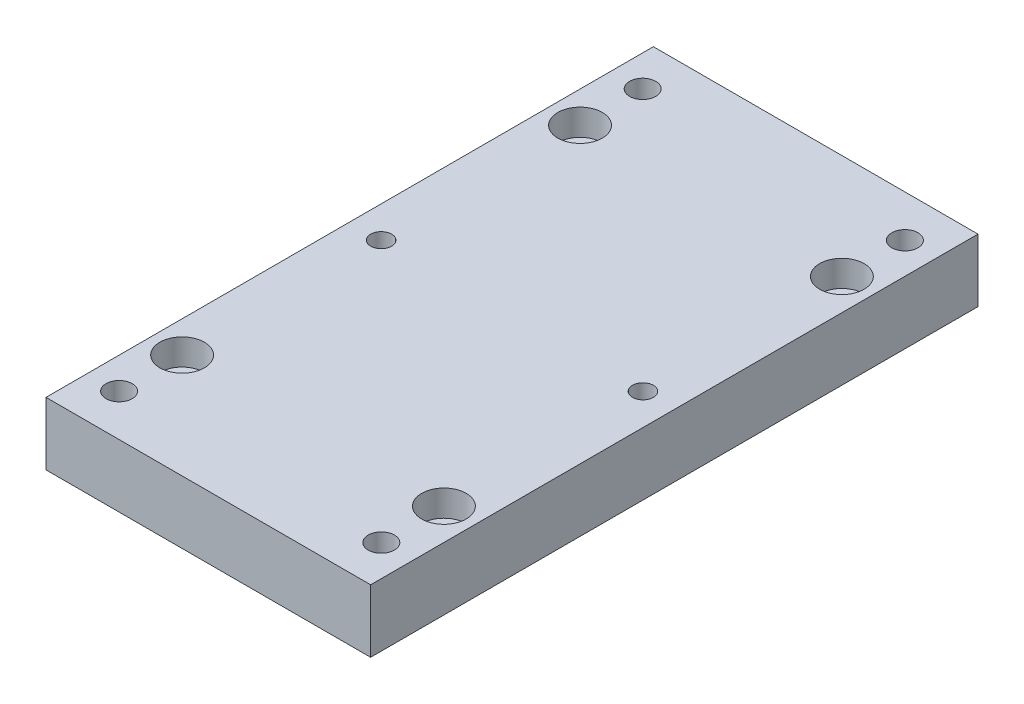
ISO-10303-21;
HEADER;
FILE_DESCRIPTION(('STEP AP214'),'2;1');
FILE_NAME('part.step','',(''),(''),'','','');
FILE_SCHEMA(('AUTOMOTIVE_DESIGN { 1 0 10303 214 1 1 1 1 }'));
ENDSEC;
DATA;
#1=APPLICATION_CONTEXT('core data for automotive mechanical design processes');
#2=APPLICATION_PROTOCOL_DEFINITION('international standard','automotive_design',2000,#1);
#3=PRODUCT_CONTEXT('',#1,'mechanical');
#4=PRODUCT('Part','Part','',(#3));
#5=PRODUCT_RELATED_PRODUCT_CATEGORY('part','',(#4));
#6=PRODUCT_DEFINITION_FORMATION('','',#4);
#7=PRODUCT_DEFINITION_CONTEXT('part definition',#1,'design');
#8=PRODUCT_DEFINITION('design','',#6,#7);
#9=PRODUCT_DEFINITION_SHAPE('','',#8);
#10=(LENGTH_UNIT() NAMED_UNIT(*) SI_UNIT(.MILLI.,.METRE.));
#11=(NAMED_UNIT(*) PLANE_ANGLE_UNIT() SI_UNIT($,.RADIAN.));
#12=(NAMED_UNIT(*) SI_UNIT($,.STERADIAN.) SOLID_ANGLE_UNIT());
#13=UNCERTAINTY_MEASURE_WITH_UNIT(LENGTH_MEASURE(1.E-05),#10,'distance_accuracy_value','');
#14=(GEOMETRIC_REPRESENTATION_CONTEXT(3) GLOBAL_UNCERTAINTY_ASSIGNED_CONTEXT((#13)) GLOBAL_UNIT_ASSIGNED_CONTEXT((#10,
#11,#12)) REPRESENTATION_CONTEXT('',''));
#15=CARTESIAN_POINT('',(0.,0.,0.));
#16=DIRECTION('',(0.,0.,1.));
#17=DIRECTION('',(1.,0.,0.));
#18=AXIS2_PLACEMENT_3D('',#15,#16,#17);
#19=CARTESIAN_POINT('',(49.2125,19.05,-92.075));
#20=DIRECTION('',(-1.,0.,0.));
#21=DIRECTION('',(0.,0.,1.));
#22=AXIS2_PLACEMENT_3D('',#19,#20,#21);
#23=PLANE('',#22);
#24=DIRECTION('',(0.,0.,-1.));
#25=VECTOR('',#24,1.);
#26=CARTESIAN_POINT('',(49.2125,0.,-92.075));
#27=LINE('',#26,#25);
#28=CARTESIAN_POINT('',(49.2125,0.,92.075));
#29=VERTEX_POINT('',#28);
#30=CARTESIAN_POINT('',(49.2125,0.,-92.075));
#31=VERTEX_POINT('',#30);
#32=EDGE_CURVE('E99',#29,#31,#27,.T.);
#33=ORIENTED_EDGE('',*,*,#32,.T.);
#34=DIRECTION('',(0.,-1.,0.));
#35=VECTOR('',#34,1.);
#36=CARTESIAN_POINT('',(49.2125,19.05,-92.075));
#37=LINE('',#36,#35);
#38=CARTESIAN_POINT('',(49.2125,19.05,-92.075));
#39=VERTEX_POINT('',#38);
#40=EDGE_CURVE('E11',#39,#31,#37,.T.);
#41=ORIENTED_EDGE('',*,*,#40,.F.);
#42=DIRECTION('',(0.,0.,-1.));
#43=VECTOR('',#42,1.);
#44=CARTESIAN_POINT('',(49.2125,19.05,-92.075));
#45=LINE('',#44,#43);
#46=CARTESIAN_POINT('',(49.2125,19.05,92.075));
#47=VERTEX_POINT('',#46);
#48=EDGE_CURVE('E87',#47,#39,#45,.T.);
#49=ORIENTED_EDGE('',*,*,#48,.F.);
#50=DIRECTION('',(0.,-1.,0.));
#51=VECTOR('',#50,1.);
#52=CARTESIAN_POINT('',(49.2125,19.05,92.075));
#53=LINE('',#52,#51);
#54=EDGE_CURVE('E95',#47,#29,#53,.T.);
#55=ORIENTED_EDGE('',*,*,#54,.T.);
#56=EDGE_LOOP('',(#33,#41,#49,#55));
#57=FACE_BOUND('',#56,.T.);
#58=ADVANCED_FACE('F36',(#57),#23,.F.);
#59=CARTESIAN_POINT('',(-49.2125,19.05,-92.075));
#60=DIRECTION('',(0.,0.,1.));
#61=DIRECTION('',(1.,0.,0.));
#62=AXIS2_PLACEMENT_3D('',#59,#60,#61);
#63=PLANE('',#62);
#64=DIRECTION('',(-1.,0.,0.));
#65=VECTOR('',#64,1.);
#66=CARTESIAN_POINT('',(-49.2125,0.,-92.075));
#67=LINE('',#66,#65);
#68=CARTESIAN_POINT('',(-49.2125,0.,-92.075));
#69=VERTEX_POINT('',#68);
#70=EDGE_CURVE('E91',#31,#69,#67,.T.);
#71=ORIENTED_EDGE('',*,*,#70,.T.);
#72=DIRECTION('',(0.,-1.,0.));
#73=VECTOR('',#72,1.);
#74=CARTESIAN_POINT('',(-49.2125,19.05,-92.075));
#75=LINE('',#74,#73);
#76=CARTESIAN_POINT('',(-49.2125,19.05,-92.075));
#77=VERTEX_POINT('',#76);
#78=EDGE_CURVE('E44',#77,#69,#75,.T.);
#79=ORIENTED_EDGE('',*,*,#78,.F.);
#80=DIRECTION('',(-1.,0.,0.));
#81=VECTOR('',#80,1.);
#82=CARTESIAN_POINT('',(-49.2125,19.05,-92.075));
#83=LINE('',#82,#81);
#84=EDGE_CURVE('E82',#39,#77,#83,.T.);
#85=ORIENTED_EDGE('',*,*,#84,.F.);
#86=ORIENTED_EDGE('',*,*,#40,.T.);
#87=EDGE_LOOP('',(#71,#79,#85,#86));
#88=FACE_BOUND('',#87,.T.);
#89=ADVANCED_FACE('F90',(#88),#63,.F.);
#90=CARTESIAN_POINT('',(-49.2125,19.05,-92.075));
#91=DIRECTION('',(1.,0.,0.));
#92=DIRECTION('',(0.,0.,-1.));
#93=AXIS2_PLACEMENT_3D('',#90,#91,#92);
#94=PLANE('',#93);
#95=DIRECTION('',(0.,0.,1.));
#96=VECTOR('',#95,1.);
#97=CARTESIAN_POINT('',(-49.2125,0.,-92.075));
#98=LINE('',#97,#96);
#99=CARTESIAN_POINT('',(-49.2125,0.,92.075));
#100=VERTEX_POINT('',#99);
#101=EDGE_CURVE('E69',#69,#100,#98,.T.);
#102=ORIENTED_EDGE('',*,*,#101,.T.);
#103=DIRECTION('',(0.,-1.,0.));
#104=VECTOR('',#103,1.);
#105=CARTESIAN_POINT('',(-49.2125,19.05,92.075));
#106=LINE('',#105,#104);
#107=CARTESIAN_POINT('',(-49.2125,19.05,92.075));
#108=VERTEX_POINT('',#107);
#109=EDGE_CURVE('E92',#108,#100,#106,.T.);
#110=ORIENTED_EDGE('',*,*,#109,.F.);
#111=DIRECTION('',(0.,0.,1.));
#112=VECTOR('',#111,1.);
#113=CARTESIAN_POINT('',(-49.2125,19.05,-92.075));
#114=LINE('',#113,#112);
#115=EDGE_CURVE('E85',#77,#108,#114,.T.);
#116=ORIENTED_EDGE('',*,*,#115,.F.);
#117=ORIENTED_EDGE('',*,*,#78,.T.);
#118=EDGE_LOOP('',(#102,#110,#116,#117));
#119=FACE_BOUND('',#118,.T.);
#120=ADVANCED_FACE('F93',(#119),#94,.F.);
#121=CARTESIAN_POINT('',(-49.2125,19.05,92.075));
#122=DIRECTION('',(0.,0.,-1.));
#123=DIRECTION('',(-1.,0.,0.));
#124=AXIS2_PLACEMENT_3D('',#121,#122,#123);
#125=PLANE('',#124);
#126=DIRECTION('',(1.,0.,0.));
#127=VECTOR('',#126,1.);
#128=CARTESIAN_POINT('',(-49.2125,0.,92.075));
#129=LINE('',#128,#127);
#130=EDGE_CURVE('E75',#100,#29,#129,.T.);
#131=ORIENTED_EDGE('',*,*,#130,.T.);
#132=ORIENTED_EDGE('',*,*,#54,.F.);
#133=DIRECTION('',(1.,0.,0.));
#134=VECTOR('',#133,1.);
#135=CARTESIAN_POINT('',(-49.2125,19.05,92.075));
#136=LINE('',#135,#134);
#137=EDGE_CURVE('E52',#108,#47,#136,.T.);
#138=ORIENTED_EDGE('',*,*,#137,.F.);
#139=ORIENTED_EDGE('',*,*,#109,.T.);
#140=EDGE_LOOP('',(#131,#132,#138,#139));
#141=FACE_BOUND('',#140,.T.);
#142=ADVANCED_FACE('F107',(#141),#125,.F.);
#143=CARTESIAN_POINT('',(0.,19.05,0.));
#144=DIRECTION('',(0.,1.,0.));
#145=DIRECTION('',(0.,0.,1.));
#146=AXIS2_PLACEMENT_3D('',#143,#144,#145);
#147=PLANE('',#146);
#148=CARTESIAN_POINT('',(-39.751,19.05,-79.3749999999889));
#149=DIRECTION('',(0.,1.,0.));
#150=DIRECTION('',(0.,0.,1.));
#151=AXIS2_PLACEMENT_3D('',#148,#149,#150);
#152=CIRCLE('',#151,3.96875);
#153=CARTESIAN_POINT('',(-39.751,19.05,-75.4062499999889));
#154=VERTEX_POINT('',#153);
#155=EDGE_CURVE('E193',#154,#154,#152,.T.);
#156=ORIENTED_EDGE('',*,*,#155,.F.);
#157=EDGE_LOOP('',(#156));
#158=FACE_BOUND('',#157,.T.);
#159=CARTESIAN_POINT('',(39.751,19.05,-79.3749999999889));
#160=DIRECTION('',(0.,1.,0.));
#161=DIRECTION('',(0.,0.,1.));
#162=AXIS2_PLACEMENT_3D('',#159,#160,#161);
#163=CIRCLE('',#162,3.96875);
#164=CARTESIAN_POINT('',(39.751,19.05,-75.4062499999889));
#165=VERTEX_POINT('',#164);
#166=EDGE_CURVE('E187',#165,#165,#163,.T.);
#167=ORIENTED_EDGE('',*,*,#166,.F.);
#168=EDGE_LOOP('',(#167));
#169=FACE_BOUND('',#168,.T.);
#170=CARTESIAN_POINT('',(-39.751,19.05,79.3750000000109));
#171=DIRECTION('',(0.,1.,0.));
#172=DIRECTION('',(0.,0.,1.));
#173=AXIS2_PLACEMENT_3D('',#170,#171,#172);
#174=CIRCLE('',#173,3.96875);
#175=CARTESIAN_POINT('',(-39.751,19.05,83.3437500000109));
#176=VERTEX_POINT('',#175);
#177=EDGE_CURVE('E181',#176,#176,#174,.T.);
#178=ORIENTED_EDGE('',*,*,#177,.F.);
#179=EDGE_LOOP('',(#178));
#180=FACE_BOUND('',#179,.T.);
#181=CARTESIAN_POINT('',(39.751,19.05,79.3750000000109));
#182=DIRECTION('',(0.,1.,0.));
#183=DIRECTION('',(0.,0.,1.));
#184=AXIS2_PLACEMENT_3D('',#181,#182,#183);
#185=CIRCLE('',#184,3.96875);
#186=CARTESIAN_POINT('',(39.751,19.05,83.3437500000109));
#187=VERTEX_POINT('',#186);
#188=EDGE_CURVE('E175',#187,#187,#185,.T.);
#189=ORIENTED_EDGE('',*,*,#188,.F.);
#190=EDGE_LOOP('',(#189));
#191=FACE_BOUND('',#190,.T.);
#192=CARTESIAN_POINT('',(39.7002,19.05,0.));
#193=DIRECTION('',(0.,-1.,0.));
#194=DIRECTION('',(0.,0.,-1.));
#195=AXIS2_PLACEMENT_3D('',#192,#193,#194);
#196=CIRCLE('',#195,3.175);
#197=CARTESIAN_POINT('',(39.7002,19.05,-3.175));
#198=VERTEX_POINT('',#197);
#199=EDGE_CURVE('E166',#198,#198,#196,.T.);
#200=ORIENTED_EDGE('',*,*,#199,.T.);
#201=EDGE_LOOP('',(#200));
#202=FACE_BOUND('',#201,.T.);
#203=CARTESIAN_POINT('',(-39.6748,19.05,0.));
#204=DIRECTION('',(0.,-1.,0.));
#205=DIRECTION('',(0.,0.,-1.));
#206=AXIS2_PLACEMENT_3D('',#203,#204,#205);
#207=CIRCLE('',#206,3.175);
#208=CARTESIAN_POINT('',(-39.6748,19.05,-3.175));
#209=VERTEX_POINT('',#208);
#210=EDGE_CURVE('E160',#209,#209,#207,.T.);
#211=ORIENTED_EDGE('',*,*,#210,.T.);
#212=EDGE_LOOP('',(#211));
#213=FACE_BOUND('',#212,.T.);
#214=CARTESIAN_POINT('',(-39.6875,19.05,-60.325));
#215=DIRECTION('',(0.,1.,0.));
#216=DIRECTION('',(0.,0.,1.));
#217=AXIS2_PLACEMENT_3D('',#214,#215,#216);
#218=CIRCLE('',#217,6.74751);
#219=CARTESIAN_POINT('',(-39.6875,19.05,-53.57749));
#220=VERTEX_POINT('',#219);
#221=EDGE_CURVE('E157',#220,#220,#218,.T.);
#222=ORIENTED_EDGE('',*,*,#221,.F.);
#223=EDGE_LOOP('',(#222));
#224=FACE_BOUND('',#223,.T.);
#225=CARTESIAN_POINT('',(-39.6875,19.05,60.325));
#226=DIRECTION('',(0.,1.,0.));
#227=DIRECTION('',(0.,0.,1.));
#228=AXIS2_PLACEMENT_3D('',#225,#226,#227);
#229=CIRCLE('',#228,6.74751);
#230=CARTESIAN_POINT('',(-39.6875,19.05,67.07251));
#231=VERTEX_POINT('',#230);
#232=EDGE_CURVE('E145',#231,#231,#229,.T.);
#233=ORIENTED_EDGE('',*,*,#232,.F.);
#234=EDGE_LOOP('',(#233));
#235=FACE_BOUND('',#234,.T.);
#236=CARTESIAN_POINT('',(39.6875,19.05,-60.325));
#237=DIRECTION('',(0.,1.,0.));
#238=DIRECTION('',(0.,0.,1.));
#239=AXIS2_PLACEMENT_3D('',#236,#237,#238);
#240=CIRCLE('',#239,6.74751);
#241=CARTESIAN_POINT('',(39.6875,19.05,-53.57749));
#242=VERTEX_POINT('',#241);
#243=EDGE_CURVE('E133',#242,#242,#240,.T.);
#244=ORIENTED_EDGE('',*,*,#243,.F.);
#245=EDGE_LOOP('',(#244));
#246=FACE_BOUND('',#245,.T.);
#247=CARTESIAN_POINT('',(39.6875,19.05,60.325));
#248=DIRECTION('',(0.,1.,0.));
#249=DIRECTION('',(0.,0.,1.));
#250=AXIS2_PLACEMENT_3D('',#247,#248,#249);
#251=CIRCLE('',#250,6.74751);
#252=CARTESIAN_POINT('',(39.6875,19.05,67.07251));
#253=VERTEX_POINT('',#252);
#254=EDGE_CURVE('E121',#253,#253,#251,.T.);
#255=ORIENTED_EDGE('',*,*,#254,.F.);
#256=EDGE_LOOP('',(#255));
#257=FACE_BOUND('',#256,.T.);
#258=ORIENTED_EDGE('',*,*,#48,.T.);
#259=ORIENTED_EDGE('',*,*,#84,.T.);
#260=ORIENTED_EDGE('',*,*,#115,.T.);
#261=ORIENTED_EDGE('',*,*,#137,.T.);
#262=EDGE_LOOP('',(#258,#259,#260,#261));
#263=FACE_BOUND('',#262,.T.);
#264=ADVANCED_FACE('F83',(#158,#169,#180,#191,#202,#213,#224,#235,#246,#257,#263),#147,.T.);
#265=CARTESIAN_POINT('',(0.,0.,0.));
#266=DIRECTION('',(0.,1.,0.));
#267=DIRECTION('',(0.,0.,1.));
#268=AXIS2_PLACEMENT_3D('',#265,#266,#267);
#269=PLANE('',#268);
#270=CARTESIAN_POINT('',(-39.751,0.,-79.3749999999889));
#271=DIRECTION('',(0.,1.,0.));
#272=DIRECTION('',(0.,0.,1.));
#273=AXIS2_PLACEMENT_3D('',#270,#271,#272);
#274=CIRCLE('',#273,3.96874999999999);
#275=CARTESIAN_POINT('',(-39.751,0.,-75.4062499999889));
#276=VERTEX_POINT('',#275);
#277=EDGE_CURVE('E190',#276,#276,#274,.T.);
#278=ORIENTED_EDGE('',*,*,#277,.T.);
#279=EDGE_LOOP('',(#278));
#280=FACE_BOUND('',#279,.T.);
#281=CARTESIAN_POINT('',(39.751,0.,-79.3749999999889));
#282=DIRECTION('',(0.,1.,0.));
#283=DIRECTION('',(0.,0.,1.));
#284=AXIS2_PLACEMENT_3D('',#281,#282,#283);
#285=CIRCLE('',#284,3.96874999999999);
#286=CARTESIAN_POINT('',(39.751,0.,-75.4062499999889));
#287=VERTEX_POINT('',#286);
#288=EDGE_CURVE('E184',#287,#287,#285,.T.);
#289=ORIENTED_EDGE('',*,*,#288,.T.);
#290=EDGE_LOOP('',(#289));
#291=FACE_BOUND('',#290,.T.);
#292=CARTESIAN_POINT('',(-39.751,0.,79.3750000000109));
#293=DIRECTION('',(0.,1.,0.));
#294=DIRECTION('',(0.,0.,1.));
#295=AXIS2_PLACEMENT_3D('',#292,#293,#294);
#296=CIRCLE('',#295,3.96875);
#297=CARTESIAN_POINT('',(-39.751,0.,83.3437500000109));
#298=VERTEX_POINT('',#297);
#299=EDGE_CURVE('E178',#298,#298,#296,.T.);
#300=ORIENTED_EDGE('',*,*,#299,.T.);
#301=EDGE_LOOP('',(#300));
#302=FACE_BOUND('',#301,.T.);
#303=CARTESIAN_POINT('',(39.751,0.,79.3750000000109));
#304=DIRECTION('',(0.,1.,0.));
#305=DIRECTION('',(0.,0.,1.));
#306=AXIS2_PLACEMENT_3D('',#303,#304,#305);
#307=CIRCLE('',#306,3.96875);
#308=CARTESIAN_POINT('',(39.751,0.,83.3437500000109));
#309=VERTEX_POINT('',#308);
#310=EDGE_CURVE('E172',#309,#309,#307,.T.);
#311=ORIENTED_EDGE('',*,*,#310,.T.);
#312=EDGE_LOOP('',(#311));
#313=FACE_BOUND('',#312,.T.);
#314=CARTESIAN_POINT('',(39.7002,0.,0.));
#315=DIRECTION('',(0.,-1.,0.));
#316=DIRECTION('',(0.,0.,-1.));
#317=AXIS2_PLACEMENT_3D('',#314,#315,#316);
#318=CIRCLE('',#317,3.175);
#319=CARTESIAN_POINT('',(39.7002,0.,-3.175));
#320=VERTEX_POINT('',#319);
#321=EDGE_CURVE('E169',#320,#320,#318,.T.);
#322=ORIENTED_EDGE('',*,*,#321,.F.);
#323=EDGE_LOOP('',(#322));
#324=FACE_BOUND('',#323,.T.);
#325=CARTESIAN_POINT('',(-39.6748,0.,0.));
#326=DIRECTION('',(0.,-1.,0.));
#327=DIRECTION('',(0.,0.,-1.));
#328=AXIS2_PLACEMENT_3D('',#325,#326,#327);
#329=CIRCLE('',#328,3.175);
#330=CARTESIAN_POINT('',(-39.6748,0.,-3.175));
#331=VERTEX_POINT('',#330);
#332=EDGE_CURVE('E163',#331,#331,#329,.T.);
#333=ORIENTED_EDGE('',*,*,#332,.F.);
#334=EDGE_LOOP('',(#333));
#335=FACE_BOUND('',#334,.T.);
#336=CARTESIAN_POINT('',(-39.6875,0.,-60.325));
#337=DIRECTION('',(0.,1.,0.));
#338=DIRECTION('',(0.,0.,1.));
#339=AXIS2_PLACEMENT_3D('',#336,#337,#338);
#340=CIRCLE('',#339,4.21639999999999);
#341=CARTESIAN_POINT('',(-39.6875,0.,-56.1086));
#342=VERTEX_POINT('',#341);
#343=EDGE_CURVE('E148',#342,#342,#340,.T.);
#344=ORIENTED_EDGE('',*,*,#343,.T.);
#345=EDGE_LOOP('',(#344));
#346=FACE_BOUND('',#345,.T.);
#347=CARTESIAN_POINT('',(-39.6875,0.,60.325));
#348=DIRECTION('',(0.,1.,0.));
#349=DIRECTION('',(0.,0.,1.));
#350=AXIS2_PLACEMENT_3D('',#347,#348,#349);
#351=CIRCLE('',#350,4.21639999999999);
#352=CARTESIAN_POINT('',(-39.6875,0.,64.5414));
#353=VERTEX_POINT('',#352);
#354=EDGE_CURVE('E136',#353,#353,#351,.T.);
#355=ORIENTED_EDGE('',*,*,#354,.T.);
#356=EDGE_LOOP('',(#355));
#357=FACE_BOUND('',#356,.T.);
#358=CARTESIAN_POINT('',(39.6875,0.,-60.325));
#359=DIRECTION('',(0.,1.,0.));
#360=DIRECTION('',(0.,0.,1.));
#361=AXIS2_PLACEMENT_3D('',#358,#359,#360);
#362=CIRCLE('',#361,4.21639999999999);
#363=CARTESIAN_POINT('',(39.6875,0.,-56.1086));
#364=VERTEX_POINT('',#363);
#365=EDGE_CURVE('E124',#364,#364,#362,.T.);
#366=ORIENTED_EDGE('',*,*,#365,.T.);
#367=EDGE_LOOP('',(#366));
#368=FACE_BOUND('',#367,.T.);
#369=CARTESIAN_POINT('',(39.6875,0.,60.325));
#370=DIRECTION('',(0.,1.,0.));
#371=DIRECTION('',(0.,0.,1.));
#372=AXIS2_PLACEMENT_3D('',#369,#370,#371);
#373=CIRCLE('',#372,4.21639999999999);
#374=CARTESIAN_POINT('',(39.6875,0.,64.5414));
#375=VERTEX_POINT('',#374);
#376=EDGE_CURVE('E102',#375,#375,#373,.T.);
#377=ORIENTED_EDGE('',*,*,#376,.T.);
#378=EDGE_LOOP('',(#377));
#379=FACE_BOUND('',#378,.T.);
#380=ORIENTED_EDGE('',*,*,#32,.F.);
#381=ORIENTED_EDGE('',*,*,#130,.F.);
#382=ORIENTED_EDGE('',*,*,#101,.F.);
#383=ORIENTED_EDGE('',*,*,#70,.F.);
#384=EDGE_LOOP('',(#380,#381,#382,#383));
#385=FACE_BOUND('',#384,.T.);
#386=ADVANCED_FACE('F110',(#280,#291,#302,#313,#324,#335,#346,#357,#368,#379,#385),#269,.F.);
#387=CARTESIAN_POINT('',(39.6875,19.05,60.325));
#388=DIRECTION('',(0.,1.,0.));
#389=DIRECTION('',(0.,0.,1.));
#390=AXIS2_PLACEMENT_3D('',#387,#388,#389);
#391=CYLINDRICAL_SURFACE('',#390,4.21639999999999);
#392=ORIENTED_EDGE('',*,*,#376,.F.);
#393=EDGE_LOOP('',(#392));
#394=FACE_BOUND('',#393,.T.);
#395=CARTESIAN_POINT('',(39.6875,11.1125,60.325));
#396=DIRECTION('',(0.,1.,0.));
#397=DIRECTION('',(0.,0.,1.));
#398=AXIS2_PLACEMENT_3D('',#395,#396,#397);
#399=CIRCLE('',#398,4.21639999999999);
#400=CARTESIAN_POINT('',(39.6875,11.1125,64.5414));
#401=VERTEX_POINT('',#400);
#402=EDGE_CURVE('E115',#401,#401,#399,.T.);
#403=ORIENTED_EDGE('',*,*,#402,.T.);
#404=EDGE_LOOP('',(#403));
#405=FACE_BOUND('',#404,.T.);
#406=ADVANCED_FACE('F233',(#394,#405),#391,.F.);
#407=CARTESIAN_POINT('',(43.9039,11.1125,60.325));
#408=DIRECTION('',(0.,-1.,0.));
#409=DIRECTION('',(0.,0.,-1.));
#410=AXIS2_PLACEMENT_3D('',#407,#408,#409);
#411=PLANE('',#410);
#412=ORIENTED_EDGE('',*,*,#402,.F.);
#413=EDGE_LOOP('',(#412));
#414=FACE_BOUND('',#413,.T.);
#415=CARTESIAN_POINT('',(39.6875,11.1125,60.325));
#416=DIRECTION('',(0.,1.,0.));
#417=DIRECTION('',(0.,0.,1.));
#418=AXIS2_PLACEMENT_3D('',#415,#416,#417);
#419=CIRCLE('',#418,6.74751);
#420=CARTESIAN_POINT('',(39.6875,11.1125,67.07251));
#421=VERTEX_POINT('',#420);
#422=EDGE_CURVE('E118',#421,#421,#419,.T.);
#423=ORIENTED_EDGE('',*,*,#422,.T.);
#424=EDGE_LOOP('',(#423));
#425=FACE_BOUND('',#424,.T.);
#426=ADVANCED_FACE('F223',(#414,#425),#411,.F.);
#427=CARTESIAN_POINT('',(39.6875,19.05,60.325));
#428=DIRECTION('',(0.,1.,0.));
#429=DIRECTION('',(0.,0.,1.));
#430=AXIS2_PLACEMENT_3D('',#427,#428,#429);
#431=CYLINDRICAL_SURFACE('',#430,6.74751);
#432=ORIENTED_EDGE('',*,*,#422,.F.);
#433=EDGE_LOOP('',(#432));
#434=FACE_BOUND('',#433,.T.);
#435=ORIENTED_EDGE('',*,*,#254,.T.);
#436=EDGE_LOOP('',(#435));
#437=FACE_BOUND('',#436,.T.);
#438=ADVANCED_FACE('F220',(#434,#437),#431,.F.);
#439=CARTESIAN_POINT('',(39.6875,19.05,-60.325));
#440=DIRECTION('',(0.,1.,0.));
#441=DIRECTION('',(0.,0.,1.));
#442=AXIS2_PLACEMENT_3D('',#439,#440,#441);
#443=CYLINDRICAL_SURFACE('',#442,4.21639999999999);
#444=ORIENTED_EDGE('',*,*,#365,.F.);
#445=EDGE_LOOP('',(#444));
#446=FACE_BOUND('',#445,.T.);
#447=CARTESIAN_POINT('',(39.6875,11.1125,-60.325));
#448=DIRECTION('',(0.,1.,0.));
#449=DIRECTION('',(0.,0.,1.));
#450=AXIS2_PLACEMENT_3D('',#447,#448,#449);
#451=CIRCLE('',#450,4.21639999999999);
#452=CARTESIAN_POINT('',(39.6875,11.1125,-56.1086));
#453=VERTEX_POINT('',#452);
#454=EDGE_CURVE('E127',#453,#453,#451,.T.);
#455=ORIENTED_EDGE('',*,*,#454,.T.);
#456=EDGE_LOOP('',(#455));
#457=FACE_BOUND('',#456,.T.);
#458=ADVANCED_FACE('F222',(#446,#457),#443,.F.);
#459=CARTESIAN_POINT('',(43.9039,11.1125,-60.325));
#460=DIRECTION('',(0.,-1.,0.));
#461=DIRECTION('',(0.,0.,-1.));
#462=AXIS2_PLACEMENT_3D('',#459,#460,#461);
#463=PLANE('',#462);
#464=ORIENTED_EDGE('',*,*,#454,.F.);
#465=EDGE_LOOP('',(#464));
#466=FACE_BOUND('',#465,.T.);
#467=CARTESIAN_POINT('',(39.6875,11.1125,-60.325));
#468=DIRECTION('',(0.,1.,0.));
#469=DIRECTION('',(0.,0.,1.));
#470=AXIS2_PLACEMENT_3D('',#467,#468,#469);
#471=CIRCLE('',#470,6.74751);
#472=CARTESIAN_POINT('',(39.6875,11.1125,-53.57749));
#473=VERTEX_POINT('',#472);
#474=EDGE_CURVE('E130',#473,#473,#471,.T.);
#475=ORIENTED_EDGE('',*,*,#474,.T.);
#476=EDGE_LOOP('',(#475));
#477=FACE_BOUND('',#476,.T.);
#478=ADVANCED_FACE('F230',(#466,#477),#463,.F.);
#479=CARTESIAN_POINT('',(39.6875,19.05,-60.325));
#480=DIRECTION('',(0.,1.,0.));
#481=DIRECTION('',(0.,0.,1.));
#482=AXIS2_PLACEMENT_3D('',#479,#480,#481);
#483=CYLINDRICAL_SURFACE('',#482,6.74751);
#484=ORIENTED_EDGE('',*,*,#474,.F.);
#485=EDGE_LOOP('',(#484));
#486=FACE_BOUND('',#485,.T.);
#487=ORIENTED_EDGE('',*,*,#243,.T.);
#488=EDGE_LOOP('',(#487));
#489=FACE_BOUND('',#488,.T.);
#490=ADVANCED_FACE('F286',(#486,#489),#483,.F.);
#491=CARTESIAN_POINT('',(-39.6875,19.05,60.325));
#492=DIRECTION('',(0.,1.,0.));
#493=DIRECTION('',(0.,0.,1.));
#494=AXIS2_PLACEMENT_3D('',#491,#492,#493);
#495=CYLINDRICAL_SURFACE('',#494,4.21639999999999);
#496=ORIENTED_EDGE('',*,*,#354,.F.);
#497=EDGE_LOOP('',(#496));
#498=FACE_BOUND('',#497,.T.);
#499=CARTESIAN_POINT('',(-39.6875,11.1125,60.325));
#500=DIRECTION('',(0.,1.,0.));
#501=DIRECTION('',(0.,0.,1.));
#502=AXIS2_PLACEMENT_3D('',#499,#500,#501);
#503=CIRCLE('',#502,4.21639999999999);
#504=CARTESIAN_POINT('',(-39.6875,11.1125,64.5414));
#505=VERTEX_POINT('',#504);
#506=EDGE_CURVE('E139',#505,#505,#503,.T.);
#507=ORIENTED_EDGE('',*,*,#506,.T.);
#508=EDGE_LOOP('',(#507));
#509=FACE_BOUND('',#508,.T.);
#510=ADVANCED_FACE('F296',(#498,#509),#495,.F.);
#511=CARTESIAN_POINT('',(-35.4711,11.1125,60.325));
#512=DIRECTION('',(0.,-1.,0.));
#513=DIRECTION('',(0.,0.,-1.));
#514=AXIS2_PLACEMENT_3D('',#511,#512,#513);
#515=PLANE('',#514);
#516=ORIENTED_EDGE('',*,*,#506,.F.);
#517=EDGE_LOOP('',(#516));
#518=FACE_BOUND('',#517,.T.);
#519=CARTESIAN_POINT('',(-39.6875,11.1125,60.325));
#520=DIRECTION('',(0.,1.,0.));
#521=DIRECTION('',(0.,0.,1.));
#522=AXIS2_PLACEMENT_3D('',#519,#520,#521);
#523=CIRCLE('',#522,6.74751);
#524=CARTESIAN_POINT('',(-39.6875,11.1125,67.07251));
#525=VERTEX_POINT('',#524);
#526=EDGE_CURVE('E142',#525,#525,#523,.T.);
#527=ORIENTED_EDGE('',*,*,#526,.T.);
#528=EDGE_LOOP('',(#527));
#529=FACE_BOUND('',#528,.T.);
#530=ADVANCED_FACE('F306',(#518,#529),#515,.F.);
#531=CARTESIAN_POINT('',(-39.6875,19.05,60.325));
#532=DIRECTION('',(0.,1.,0.));
#533=DIRECTION('',(0.,0.,1.));
#534=AXIS2_PLACEMENT_3D('',#531,#532,#533);
#535=CYLINDRICAL_SURFACE('',#534,6.74751);
#536=ORIENTED_EDGE('',*,*,#526,.F.);
#537=EDGE_LOOP('',(#536));
#538=FACE_BOUND('',#537,.T.);
#539=ORIENTED_EDGE('',*,*,#232,.T.);
#540=EDGE_LOOP('',(#539));
#541=FACE_BOUND('',#540,.T.);
#542=ADVANCED_FACE('F316',(#538,#541),#535,.F.);
#543=CARTESIAN_POINT('',(-39.6875,19.05,-60.325));
#544=DIRECTION('',(0.,1.,0.));
#545=DIRECTION('',(0.,0.,1.));
#546=AXIS2_PLACEMENT_3D('',#543,#544,#545);
#547=CYLINDRICAL_SURFACE('',#546,4.21639999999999);
#548=ORIENTED_EDGE('',*,*,#343,.F.);
#549=EDGE_LOOP('',(#548));
#550=FACE_BOUND('',#549,.T.);
#551=CARTESIAN_POINT('',(-39.6875,11.1125,-60.325));
#552=DIRECTION('',(0.,1.,0.));
#553=DIRECTION('',(0.,0.,1.));
#554=AXIS2_PLACEMENT_3D('',#551,#552,#553);
#555=CIRCLE('',#554,4.21639999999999);
#556=CARTESIAN_POINT('',(-39.6875,11.1125,-56.1086));
#557=VERTEX_POINT('',#556);
#558=EDGE_CURVE('E151',#557,#557,#555,.T.);
#559=ORIENTED_EDGE('',*,*,#558,.T.);
#560=EDGE_LOOP('',(#559));
#561=FACE_BOUND('',#560,.T.);
#562=ADVANCED_FACE('F326',(#550,#561),#547,.F.);
#563=CARTESIAN_POINT('',(-35.4711,11.1125,-60.325));
#564=DIRECTION('',(0.,-1.,0.));
#565=DIRECTION('',(0.,0.,-1.));
#566=AXIS2_PLACEMENT_3D('',#563,#564,#565);
#567=PLANE('',#566);
#568=ORIENTED_EDGE('',*,*,#558,.F.);
#569=EDGE_LOOP('',(#568));
#570=FACE_BOUND('',#569,.T.);
#571=CARTESIAN_POINT('',(-39.6875,11.1125,-60.325));
#572=DIRECTION('',(0.,1.,0.));
#573=DIRECTION('',(0.,0.,1.));
#574=AXIS2_PLACEMENT_3D('',#571,#572,#573);
#575=CIRCLE('',#574,6.74751);
#576=CARTESIAN_POINT('',(-39.6875,11.1125,-53.57749));
#577=VERTEX_POINT('',#576);
#578=EDGE_CURVE('E154',#577,#577,#575,.T.);
#579=ORIENTED_EDGE('',*,*,#578,.T.);
#580=EDGE_LOOP('',(#579));
#581=FACE_BOUND('',#580,.T.);
#582=ADVANCED_FACE('F336',(#570,#581),#567,.F.);
#583=CARTESIAN_POINT('',(-39.6875,19.05,-60.325));
#584=DIRECTION('',(0.,1.,0.));
#585=DIRECTION('',(0.,0.,1.));
#586=AXIS2_PLACEMENT_3D('',#583,#584,#585);
#587=CYLINDRICAL_SURFACE('',#586,6.74751);
#588=ORIENTED_EDGE('',*,*,#578,.F.);
#589=EDGE_LOOP('',(#588));
#590=FACE_BOUND('',#589,.T.);
#591=ORIENTED_EDGE('',*,*,#221,.T.);
#592=EDGE_LOOP('',(#591));
#593=FACE_BOUND('',#592,.T.);
#594=ADVANCED_FACE('F346',(#590,#593),#587,.F.);
#595=CARTESIAN_POINT('',(-39.6748,0.,0.));
#596=DIRECTION('',(0.,-1.,0.));
#597=DIRECTION('',(0.,0.,-1.));
#598=AXIS2_PLACEMENT_3D('',#595,#596,#597);
#599=CYLINDRICAL_SURFACE('',#598,3.175);
#600=ORIENTED_EDGE('',*,*,#210,.F.);
#601=EDGE_LOOP('',(#600));
#602=FACE_BOUND('',#601,.T.);
#603=ORIENTED_EDGE('',*,*,#332,.T.);
#604=EDGE_LOOP('',(#603));
#605=FACE_BOUND('',#604,.T.);
#606=ADVANCED_FACE('F356',(#602,#605),#599,.F.);
#607=CARTESIAN_POINT('',(39.7002,0.,0.));
#608=DIRECTION('',(0.,-1.,0.));
#609=DIRECTION('',(0.,0.,-1.));
#610=AXIS2_PLACEMENT_3D('',#607,#608,#609);
#611=CYLINDRICAL_SURFACE('',#610,3.175);
#612=ORIENTED_EDGE('',*,*,#199,.F.);
#613=EDGE_LOOP('',(#612));
#614=FACE_BOUND('',#613,.T.);
#615=ORIENTED_EDGE('',*,*,#321,.T.);
#616=EDGE_LOOP('',(#615));
#617=FACE_BOUND('',#616,.T.);
#618=ADVANCED_FACE('F366',(#614,#617),#611,.F.);
#619=CARTESIAN_POINT('',(39.751,19.05,79.3750000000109));
#620=DIRECTION('',(0.,1.,0.));
#621=DIRECTION('',(0.,0.,1.));
#622=AXIS2_PLACEMENT_3D('',#619,#620,#621);
#623=CYLINDRICAL_SURFACE('',#622,3.96875);
#624=ORIENTED_EDGE('',*,*,#310,.F.);
#625=EDGE_LOOP('',(#624));
#626=FACE_BOUND('',#625,.T.);
#627=ORIENTED_EDGE('',*,*,#188,.T.);
#628=EDGE_LOOP('',(#627));
#629=FACE_BOUND('',#628,.T.);
#630=ADVANCED_FACE('F376',(#626,#629),#623,.F.);
#631=CARTESIAN_POINT('',(-39.751,19.05,79.3750000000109));
#632=DIRECTION('',(0.,1.,0.));
#633=DIRECTION('',(0.,0.,1.));
#634=AXIS2_PLACEMENT_3D('',#631,#632,#633);
#635=CYLINDRICAL_SURFACE('',#634,3.96875);
#636=ORIENTED_EDGE('',*,*,#299,.F.);
#637=EDGE_LOOP('',(#636));
#638=FACE_BOUND('',#637,.T.);
#639=ORIENTED_EDGE('',*,*,#177,.T.);
#640=EDGE_LOOP('',(#639));
#641=FACE_BOUND('',#640,.T.);
#642=ADVANCED_FACE('F398',(#638,#641),#635,.F.);
#643=CARTESIAN_POINT('',(39.751,19.05,-79.3749999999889));
#644=DIRECTION('',(0.,1.,0.));
#645=DIRECTION('',(0.,0.,1.));
#646=AXIS2_PLACEMENT_3D('',#643,#644,#645);
#647=CYLINDRICAL_SURFACE('',#646,3.96875);
#648=ORIENTED_EDGE('',*,*,#288,.F.);
#649=EDGE_LOOP('',(#648));
#650=FACE_BOUND('',#649,.T.);
#651=ORIENTED_EDGE('',*,*,#166,.T.);
#652=EDGE_LOOP('',(#651));
#653=FACE_BOUND('',#652,.T.);
#654=ADVANCED_FACE('F409',(#650,#653),#647,.F.);
#655=CARTESIAN_POINT('',(-39.751,19.05,-79.3749999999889));
#656=DIRECTION('',(0.,1.,0.));
#657=DIRECTION('',(0.,0.,1.));
#658=AXIS2_PLACEMENT_3D('',#655,#656,#657);
#659=CYLINDRICAL_SURFACE('',#658,3.96875);
#660=ORIENTED_EDGE('',*,*,#277,.F.);
#661=EDGE_LOOP('',(#660));
#662=FACE_BOUND('',#661,.T.);
#663=ORIENTED_EDGE('',*,*,#155,.T.);
#664=EDGE_LOOP('',(#663));
#665=FACE_BOUND('',#664,.T.);
#666=ADVANCED_FACE('F197',(#662,#665),#659,.F.);
#667=CLOSED_SHELL('',(#58,#89,#120,#142,#264,#386,#406,#426,#438,#458,#478,#490,#510,#530,#542,
#562,#582,#594,#606,#618,#630,#642,#654,#666));
#668=MANIFOLD_SOLID_BREP('B2',#667);
#669=ADVANCED_BREP_SHAPE_REPRESENTATION('',(#18,#668),#14);
#670=SHAPE_DEFINITION_REPRESENTATION(#9,#669);
ENDSEC;
END-ISO-10303-21;
